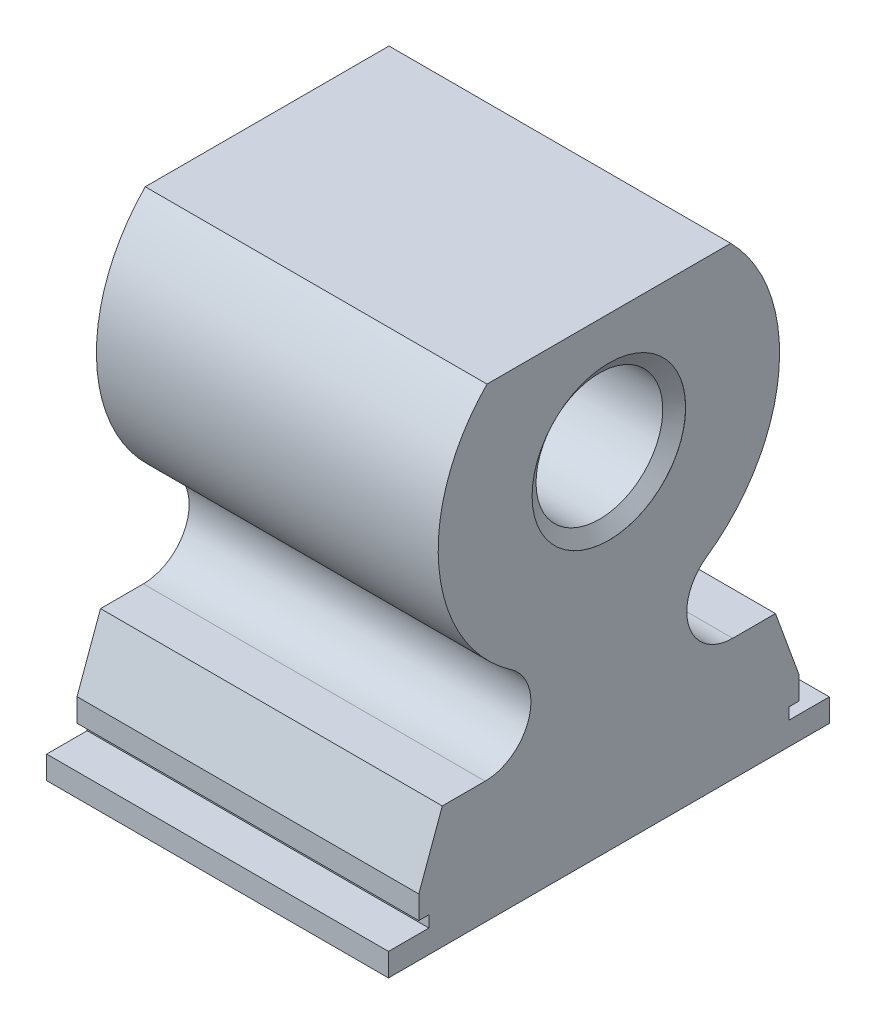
from build123d import *

# Parameters (mm, degrees)
BODYSKE_R    = 1.65
BODY_DEPTH   = 8.9
TOPCUTSKE_W  = 8.89
TOPCUTSKE_H  = 8.89
TOPCUT_DEPTH = 8.9


with BuildPart() as part:
    # BodySke → Body (new body)
    with BuildSketch(Plane(origin=(0, 0, 0), x_dir=(0, 0, -1), z_dir=(1, 0, 0))):
        with BuildLine():
            Line((-5.74, -9), (5.74, -9))
            Line((5.74, -9), (5.74, -8.4))
            Line((5.74, -8.4), (4.686666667, -8.4))
            Line((4.686666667, -8.4), (4.686666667, -8.1))
            Line((4.686666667, -8.1), (4.95, -8.1))
            Line((4.95, -8.1), (4.95, -7.5))
            Line((4.95, -7.5), (4.338530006, -5.82))
            Line((4.338530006, -5.82), (3.223696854, -5.82))
            ThreePointArc((3.223696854, -5.82), (2.08483996, -4.983958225), (2.54124896, -3.646927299))
            ThreePointArc((2.54124896, -3.646927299), (0, 4.445), (-2.54124896, -3.646927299))
            ThreePointArc((-2.54124896, -3.646927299), (-2.08483996, -4.983958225), (-3.223696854, -5.82))
            Line((-3.223696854, -5.82), (-4.338530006, -5.82))
            Line((-4.338530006, -5.82), (-4.95, -7.5))
            Line((-4.95, -7.5), (-4.95, -8.1))
            Line((-4.95, -8.1), (-4.686666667, -8.1))
            Line((-4.686666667, -8.1), (-4.686666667, -8.4))
            Line((-4.686666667, -8.4), (-5.74, -8.4))
            Line((-5.74, -8.4), (-5.74, -9))
        make_face()
        Circle(BODYSKE_R, mode=Mode.SUBTRACT)
    extrude(amount=BODY_DEPTH)

    # EndChamferSke → EndChamfer (revolve, cut)
    with BuildSketch(Plane.XY, mode=Mode.PRIVATE) as endchamfer_sk:
        Polygon((-0.254, 2), (0.00254, 2), (0.247521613, 1.65), (-0.254, 1.65), align=None)
        Polygon((9.154, 2), (8.89746, 2), (8.652478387, 1.65), (9.154, 1.65), align=None)
    revolve(endchamfer_sk.sketch.rotate(Axis((-5.105879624, 0, 0), (1, 0, 0)), 90), axis=Axis((-5.105879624, 0, 0), (1, 0, 0)), mode=Mode.SUBTRACT)

    # TopCutSke → TopCut (cut)
    with BuildSketch(Plane.ZY):
        with Locations((0, 7.5565)):
            Rectangle(TOPCUTSKE_W, TOPCUTSKE_H)
    extrude(amount=-TOPCUT_DEPTH, mode=Mode.SUBTRACT)


solid = part.part
